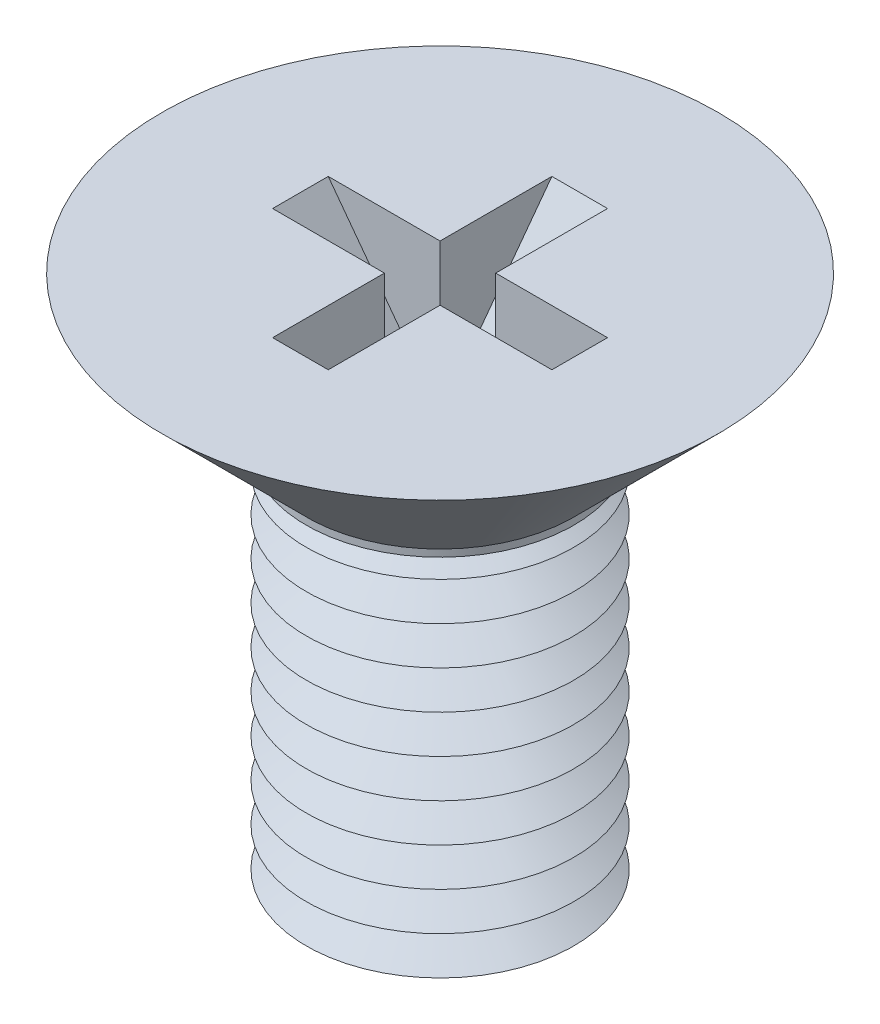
from build123d import *

# Parameters (mm, degrees)
CUT_EXTRUDE1_DEPTH = 0.52
CUT_EXTRUDE2_DEPTH = 0.52


with BuildPart() as part:
    # Sketch1 → Base-Revolve (revolve)
    with BuildSketch(Plane.XY, mode=Mode.PRIVATE) as base_revolve_sk:
        Polygon((0, 0), (2.5, 0), (5.2, 2.7), (0, 2.7), align=None)
    revolve(base_revolve_sk.sketch.rotate(Axis((0, 0, 0), (0, 1, 0)), 90), axis=Axis((0, 0, 0), (0, 1, 0)))

    # Sketch2 → Boss-Revolve1 (revolve)
    with BuildSketch(Plane.XY, mode=Mode.PRIVATE) as boss_revolve1_sk:
        Polygon((0, -7.3), (1.879225, -7.3), (2.5, -6.941595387), (1.879225, -6.583190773), (2.5, -6.22478616), (1.879225, -5.866381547), (2.5, -5.507976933), (1.879225, -5.14957232), (2.5, -4.791167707), (1.879225, -4.432763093), (2.5, -4.07435848), (1.879225, -3.715953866), (2.5, -3.357549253), (1.879225, -2.99914464), (2.5, -2.640740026), (1.879225, -2.282335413), (2.5, -1.9239308), (1.879225, -1.565526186), (2.5, -1.207121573), (1.879225, -0.84871696), (2.5, -0.490312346), (1.879225, -0.131907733), (2.5, -0.131907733), (2.5, 0), (0, 0), align=None)
    revolve(boss_revolve1_sk.sketch.rotate(Axis((0, 0, 0), (0, 1, 0)), 90), axis=Axis((0, 0, 0), (0, 1, 0)))

    # Sketch3 → Cut-Extrude1 (cut, symmetric)
    with BuildSketch(Plane.XY):
        Polygon((-2.61, 4.05), (2.61, 4.05), (2.61, 2.7), (0, -0.8), (-2.61, 2.7), align=None)
    extrude(amount=CUT_EXTRUDE1_DEPTH, both=True, mode=Mode.SUBTRACT)

    # Sketch4 → Cut-Extrude2 (cut, symmetric)
    with BuildSketch(Plane(origin=(0, 0, 0), x_dir=(0, 0, -1), z_dir=(1, 0, 0))):
        Polygon((-2.61, 4.05), (2.61, 4.05), (2.61, 2.7), (0, -0.8), (-2.61, 2.7), align=None)
    extrude(amount=CUT_EXTRUDE2_DEPTH, both=True, mode=Mode.SUBTRACT)


solid = part.part
